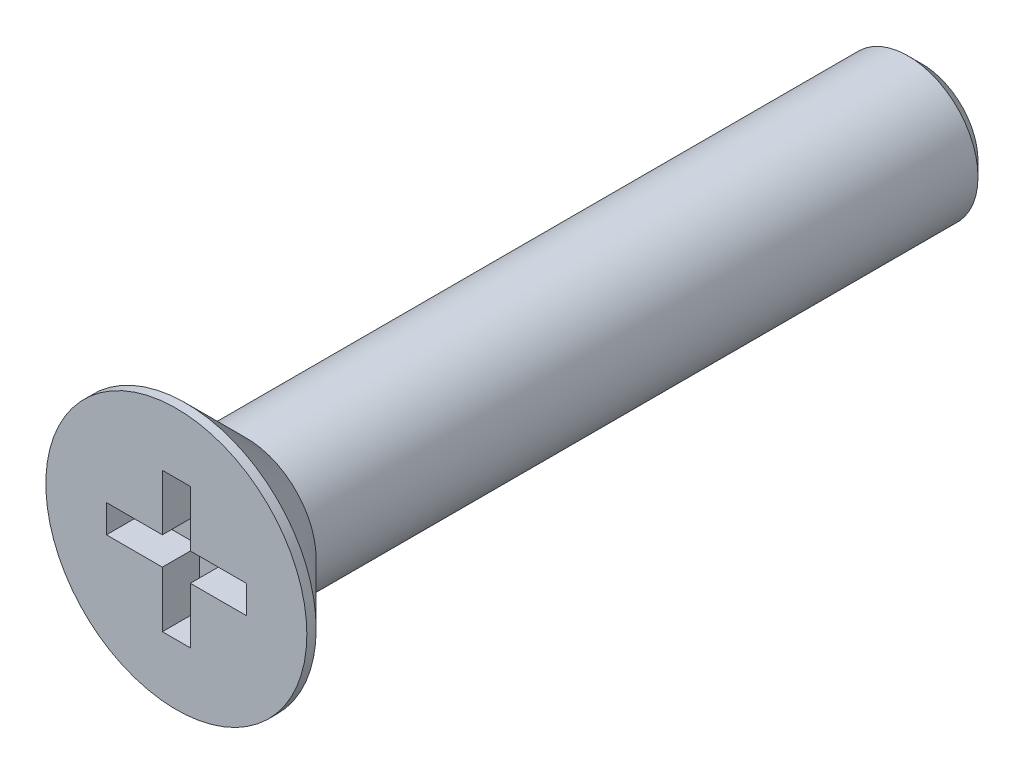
from build123d import *

# Parameters (mm, degrees)
SCHNITT_LINEAR_AUSTRAGEN1_DEPTH = 0.8
FASE1_SIZE                      = 0.3


with BuildPart() as part:
    # Skizze1 → Rotation1 (revolve)
    with BuildSketch(Plane(origin=(0, 0, 0), x_dir=(0, 0, -1), z_dir=(1, 0, 0)), mode=Mode.PRIVATE) as rotation1_sk:
        Polygon((0, 0), (0, 2.8), (0.2, 2.8), (1.5, 1.5), (16, 1.5), (16, 0), align=None)
    revolve(rotation1_sk.sketch.rotate(Axis((0, 0, 31.763581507), (0, 0, -1)), 90), axis=Axis((0, 0, 31.763581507), (0, 0, -1)))

    # Skizze3 → Schnitt-Linear austragen1 (cut)
    with BuildSketch(Plane.XY):
        Polygon((-1.5, -0.3), (-1.5, 0.3), (-0.3, 0.3), (-0.3, 1.5), (0.3, 1.5), (0.3, 0.3), (1.5, 0.3), (1.5, -0.3), (0.3, -0.3), (0.3, -1.5), (-0.3, -1.5), (-0.3, -0.3), align=None)
    extrude(amount=-SCHNITT_LINEAR_AUSTRAGEN1_DEPTH, mode=Mode.SUBTRACT)

    # Fase1
    fase1_edges = [part.edges().sort_by_distance(p)[0] for p in [
        (-1.5, 0, -16),
    ]]
    chamfer(fase1_edges, length=FASE1_SIZE)


solid = part.part
